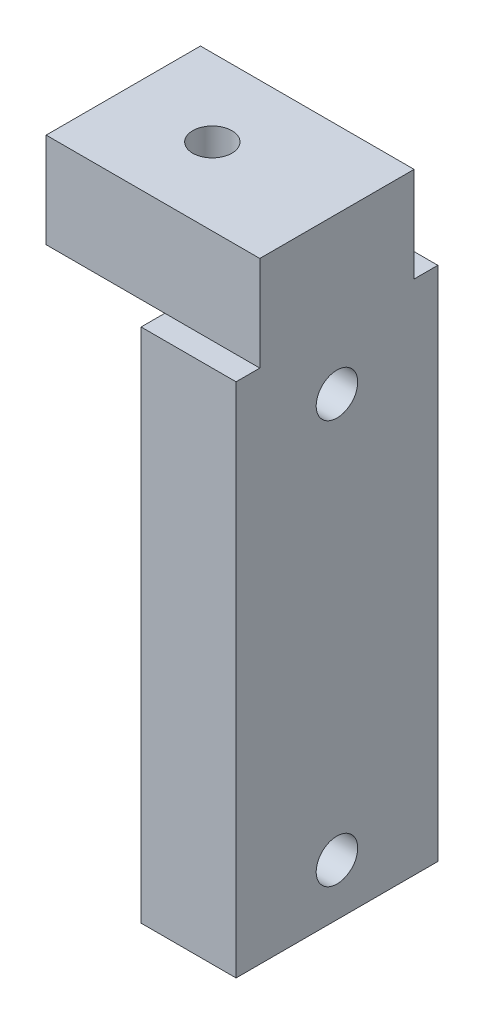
from build123d import *

# Parameters (mm, degrees)
EXTRUDE_1_DEPTH     = 17
SKETCH_2_OUTSIDE_W  = 30.428
SKETCH_2_OUTSIDE_H  = 64.928
SKETCH_2_OUTSIDE_R  = 1.75
CUT_EXTRUDE_1_DEPTH = 58.142366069
SKETCH_3_OUTSIDE_W  = 31.428
SKETCH_3_OUTSIDE_H  = 30.428
SKETCH_3_OUTSIDE_R  = 1.65
CUT_EXTRUDE_2_DEPTH = 58.142366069


with BuildPart() as part:
    # Sketch 1 → Extrude 1 (new body)
    with BuildSketch(Plane.XY):
        Polygon((0, 43.5), (10, 43.5), (10, 0), (18, 0), (18, 51.5), (0, 51.5), align=None)
    extrude(amount=EXTRUDE_1_DEPTH)

    # Sketch 2 outside → Cut-Extrude 1 (cut, through all)
    # profile 1 of 3: a face of its own
    with BuildSketch(Plane(origin=(18, 0, 0), x_dir=(0, 0, -1), z_dir=(1, 0, 0))):
        with Locations((-8.5, 25.75)):
            Rectangle(SKETCH_2_OUTSIDE_W, SKETCH_2_OUTSIDE_H)
        Polygon((-15, 43.5), (-17, 43.5), (-17, 0), (0, 0), (0, 43.5), (-2, 43.5), (-2, 51.5), (-15, 51.5), align=None, mode=Mode.SUBTRACT)
    # profile 2 of 3: a face of its own
    with BuildSketch(Plane(origin=(18, 0, 0), x_dir=(0, 0, -1), z_dir=(1, 0, 0))):
        with Locations((-8.5, 4.358253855)):
            Circle(SKETCH_2_OUTSIDE_R)
    # profile 3 of 3: a face of its own
    with BuildSketch(Plane(origin=(18, 0, 0), x_dir=(0, 0, -1), z_dir=(1, 0, 0))):
        with Locations((-8.5, 38.358253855)):
            Circle(SKETCH_2_OUTSIDE_R)
    extrude(amount=-CUT_EXTRUDE_1_DEPTH, mode=Mode.SUBTRACT)

    # Sketch 3 outside → Cut-Extrude 2 (cut, through all)
    # profile 1 of 2: a face of its own
    with BuildSketch(Plane(origin=(0, 51.5, 0), x_dir=(1, 0, 0), z_dir=(0, 1, 0))):
        with Locations((9, -8.5)):
            Rectangle(SKETCH_3_OUTSIDE_W, SKETCH_3_OUTSIDE_H)
        Polygon((10, -2), (10, 0), (18, 0), (18, -17), (10, -17), (10, -15), (0, -15), (0, -2), align=None, mode=Mode.SUBTRACT)
    # profile 2 of 2: a face of its own
    with BuildSketch(Plane(origin=(0, 51.5, 0), x_dir=(1, 0, 0), z_dir=(0, 1, 0))):
        with Locations(Location((7.5, -8.5, 0), (0, 0, 270))):
            Circle(SKETCH_3_OUTSIDE_R)
    extrude(amount=-CUT_EXTRUDE_2_DEPTH, mode=Mode.SUBTRACT)


solid = part.part
